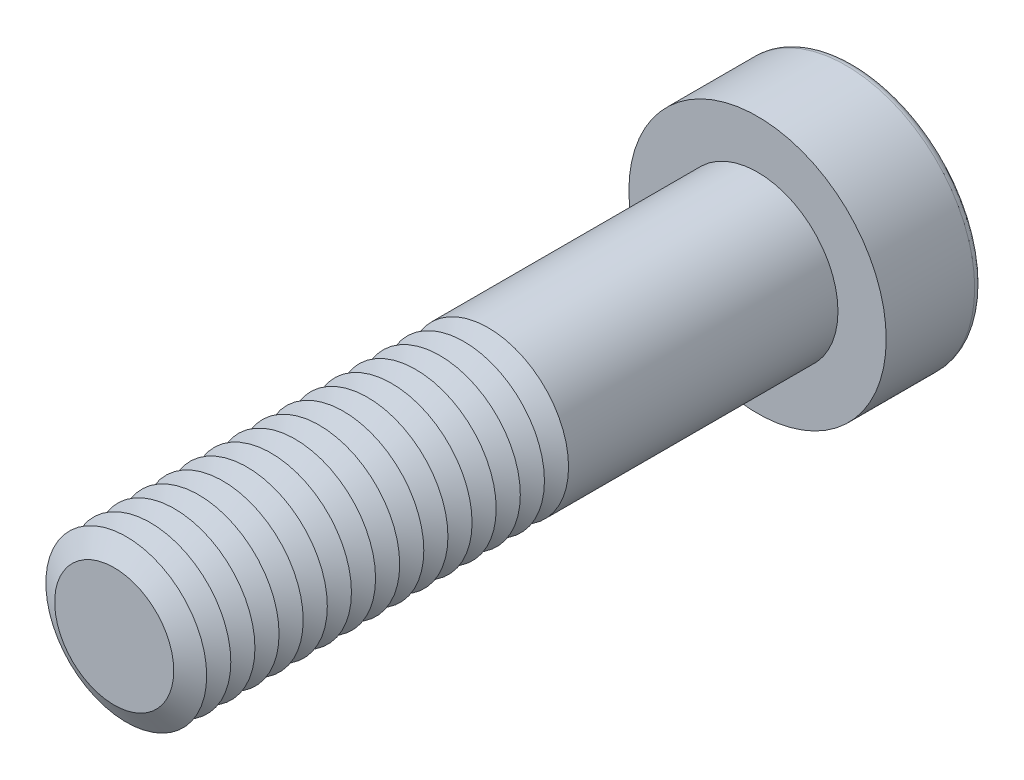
ISO-10303-21;
HEADER;
FILE_DESCRIPTION(('STEP AP214'),'2;1');
FILE_NAME('part.step','',(''),(''),'','','');
FILE_SCHEMA(('AUTOMOTIVE_DESIGN { 1 0 10303 214 1 1 1 1 }'));
ENDSEC;
DATA;
#1=APPLICATION_CONTEXT('core data for automotive mechanical design processes');
#2=APPLICATION_PROTOCOL_DEFINITION('international standard','automotive_design',2000,#1);
#3=PRODUCT_CONTEXT('',#1,'mechanical');
#4=PRODUCT('Part','Part','',(#3));
#5=PRODUCT_RELATED_PRODUCT_CATEGORY('part','',(#4));
#6=PRODUCT_DEFINITION_FORMATION('','',#4);
#7=PRODUCT_DEFINITION_CONTEXT('part definition',#1,'design');
#8=PRODUCT_DEFINITION('design','',#6,#7);
#9=PRODUCT_DEFINITION_SHAPE('','',#8);
#10=(LENGTH_UNIT() NAMED_UNIT(*) SI_UNIT(.MILLI.,.METRE.));
#11=(NAMED_UNIT(*) PLANE_ANGLE_UNIT() SI_UNIT($,.RADIAN.));
#12=(NAMED_UNIT(*) SI_UNIT($,.STERADIAN.) SOLID_ANGLE_UNIT());
#13=UNCERTAINTY_MEASURE_WITH_UNIT(LENGTH_MEASURE(1.E-05),#10,'distance_accuracy_value','');
#14=(GEOMETRIC_REPRESENTATION_CONTEXT(3) GLOBAL_UNCERTAINTY_ASSIGNED_CONTEXT((#13)) GLOBAL_UNIT_ASSIGNED_CONTEXT((#10,
#11,#12)) REPRESENTATION_CONTEXT('',''));
#15=CARTESIAN_POINT('',(0.,0.,0.));
#16=DIRECTION('',(0.,0.,1.));
#17=DIRECTION('',(1.,0.,0.));
#18=AXIS2_PLACEMENT_3D('',#15,#16,#17);
#19=CARTESIAN_POINT('',(0.,0.,34.75));
#20=DIRECTION('',(0.,0.,1.));
#21=DIRECTION('',(1.,0.,0.));
#22=AXIS2_PLACEMENT_3D('',#19,#20,#21);
#23=CONICAL_SURFACE('',#22,5.,1.0471975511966);
#24=CARTESIAN_POINT('',(0.,0.,34.));
#25=DIRECTION('',(0.,0.,1.));
#26=DIRECTION('',(1.,0.,0.));
#27=AXIS2_PLACEMENT_3D('',#24,#25,#26);
#28=CIRCLE('',#27,3.70096189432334);
#29=CARTESIAN_POINT('',(3.70096189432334,0.,34.));
#30=VERTEX_POINT('',#29);
#31=EDGE_CURVE('E313',#30,#30,#28,.T.);
#32=ORIENTED_EDGE('',*,*,#31,.T.);
#33=EDGE_LOOP('',(#32));
#34=FACE_BOUND('',#33,.T.);
#35=CARTESIAN_POINT('',(0.,0.,34.75));
#36=DIRECTION('',(0.,0.,1.));
#37=DIRECTION('',(1.,0.,0.));
#38=AXIS2_PLACEMENT_3D('',#35,#36,#37);
#39=CIRCLE('',#38,5.);
#40=CARTESIAN_POINT('',(5.,0.,34.75));
#41=VERTEX_POINT('',#40);
#42=EDGE_CURVE('E316',#41,#41,#39,.T.);
#43=ORIENTED_EDGE('',*,*,#42,.F.);
#44=EDGE_LOOP('',(#43));
#45=FACE_BOUND('',#44,.T.);
#46=ADVANCED_FACE('F39',(#34,#45),#23,.T.);
#47=CARTESIAN_POINT('',(0.,0.,34.));
#48=DIRECTION('',(0.,0.,-1.));
#49=DIRECTION('',(-1.,0.,0.));
#50=AXIS2_PLACEMENT_3D('',#47,#48,#49);
#51=CONICAL_SURFACE('',#50,3.70096189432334,1.0471975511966);
#52=CARTESIAN_POINT('',(0.,0.,33.25));
#53=DIRECTION('',(0.,0.,1.));
#54=DIRECTION('',(1.,0.,0.));
#55=AXIS2_PLACEMENT_3D('',#52,#53,#54);
#56=CIRCLE('',#55,5.);
#57=CARTESIAN_POINT('',(5.,0.,33.25));
#58=VERTEX_POINT('',#57);
#59=EDGE_CURVE('E324',#58,#58,#56,.T.);
#60=ORIENTED_EDGE('',*,*,#59,.T.);
#61=EDGE_LOOP('',(#60));
#62=FACE_BOUND('',#61,.T.);
#63=ORIENTED_EDGE('',*,*,#31,.F.);
#64=EDGE_LOOP('',(#63));
#65=FACE_BOUND('',#64,.T.);
#66=ADVANCED_FACE('F244',(#62,#65),#51,.T.);
#67=CARTESIAN_POINT('',(0.,0.,40.));
#68=DIRECTION('',(0.,0.,1.));
#69=DIRECTION('',(1.,0.,0.));
#70=AXIS2_PLACEMENT_3D('',#67,#68,#69);
#71=PLANE('',#70);
#72=CARTESIAN_POINT('',(0.,0.,40.));
#73=DIRECTION('',(0.,0.,1.));
#74=DIRECTION('',(1.,0.,0.));
#75=AXIS2_PLACEMENT_3D('',#72,#73,#74);
#76=CIRCLE('',#75,3.70096189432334);
#77=CARTESIAN_POINT('',(3.70096189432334,0.,40.));
#78=VERTEX_POINT('',#77);
#79=EDGE_CURVE('E174',#78,#78,#76,.T.);
#80=ORIENTED_EDGE('',*,*,#79,.T.);
#81=EDGE_LOOP('',(#80));
#82=FACE_BOUND('',#81,.T.);
#83=ADVANCED_FACE('F250',(#82),#71,.T.);
#84=CARTESIAN_POINT('',(0.,0.,40.));
#85=DIRECTION('',(0.,0.,-1.));
#86=DIRECTION('',(-1.,0.,0.));
#87=AXIS2_PLACEMENT_3D('',#84,#85,#86);
#88=CONICAL_SURFACE('',#87,3.70096189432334,1.0471975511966);
#89=CARTESIAN_POINT('',(0.,0.,39.25));
#90=DIRECTION('',(0.,0.,1.));
#91=DIRECTION('',(1.,0.,0.));
#92=AXIS2_PLACEMENT_3D('',#89,#90,#91);
#93=CIRCLE('',#92,5.);
#94=CARTESIAN_POINT('',(5.,0.,39.25));
#95=VERTEX_POINT('',#94);
#96=EDGE_CURVE('E290',#95,#95,#93,.T.);
#97=ORIENTED_EDGE('',*,*,#96,.T.);
#98=EDGE_LOOP('',(#97));
#99=FACE_BOUND('',#98,.T.);
#100=ORIENTED_EDGE('',*,*,#79,.F.);
#101=EDGE_LOOP('',(#100));
#102=FACE_BOUND('',#101,.T.);
#103=ADVANCED_FACE('F199',(#99,#102),#88,.T.);
#104=CARTESIAN_POINT('',(0.,0.,39.25));
#105=DIRECTION('',(0.,0.,1.));
#106=DIRECTION('',(1.,0.,0.));
#107=AXIS2_PLACEMENT_3D('',#104,#105,#106);
#108=CONICAL_SURFACE('',#107,5.,1.0471975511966);
#109=CARTESIAN_POINT('',(0.,0.,38.5));
#110=DIRECTION('',(0.,0.,1.));
#111=DIRECTION('',(1.,0.,0.));
#112=AXIS2_PLACEMENT_3D('',#109,#110,#111);
#113=CIRCLE('',#112,3.70096189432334);
#114=CARTESIAN_POINT('',(3.70096189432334,0.,38.5));
#115=VERTEX_POINT('',#114);
#116=EDGE_CURVE('E287',#115,#115,#113,.T.);
#117=ORIENTED_EDGE('',*,*,#116,.T.);
#118=EDGE_LOOP('',(#117));
#119=FACE_BOUND('',#118,.T.);
#120=ORIENTED_EDGE('',*,*,#96,.F.);
#121=EDGE_LOOP('',(#120));
#122=FACE_BOUND('',#121,.T.);
#123=ADVANCED_FACE('F276',(#119,#122),#108,.T.);
#124=CARTESIAN_POINT('',(0.,0.,38.5));
#125=DIRECTION('',(0.,0.,-1.));
#126=DIRECTION('',(-1.,0.,0.));
#127=AXIS2_PLACEMENT_3D('',#124,#125,#126);
#128=CONICAL_SURFACE('',#127,3.70096189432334,1.0471975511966);
#129=CARTESIAN_POINT('',(0.,0.,37.75));
#130=DIRECTION('',(0.,0.,1.));
#131=DIRECTION('',(1.,0.,0.));
#132=AXIS2_PLACEMENT_3D('',#129,#130,#131);
#133=CIRCLE('',#132,5.);
#134=CARTESIAN_POINT('',(5.,0.,37.75));
#135=VERTEX_POINT('',#134);
#136=EDGE_CURVE('E299',#135,#135,#133,.T.);
#137=ORIENTED_EDGE('',*,*,#136,.T.);
#138=EDGE_LOOP('',(#137));
#139=FACE_BOUND('',#138,.T.);
#140=ORIENTED_EDGE('',*,*,#116,.F.);
#141=EDGE_LOOP('',(#140));
#142=FACE_BOUND('',#141,.T.);
#143=ADVANCED_FACE('F273',(#139,#142),#128,.T.);
#144=CARTESIAN_POINT('',(0.,0.,37.75));
#145=DIRECTION('',(0.,0.,1.));
#146=DIRECTION('',(1.,0.,0.));
#147=AXIS2_PLACEMENT_3D('',#144,#145,#146);
#148=CONICAL_SURFACE('',#147,5.,1.0471975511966);
#149=CARTESIAN_POINT('',(0.,0.,37.));
#150=DIRECTION('',(0.,0.,1.));
#151=DIRECTION('',(1.,0.,0.));
#152=AXIS2_PLACEMENT_3D('',#149,#150,#151);
#153=CIRCLE('',#152,3.70096189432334);
#154=CARTESIAN_POINT('',(3.70096189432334,0.,37.));
#155=VERTEX_POINT('',#154);
#156=EDGE_CURVE('E292',#155,#155,#153,.T.);
#157=ORIENTED_EDGE('',*,*,#156,.T.);
#158=EDGE_LOOP('',(#157));
#159=FACE_BOUND('',#158,.T.);
#160=ORIENTED_EDGE('',*,*,#136,.F.);
#161=EDGE_LOOP('',(#160));
#162=FACE_BOUND('',#161,.T.);
#163=ADVANCED_FACE('F269',(#159,#162),#148,.T.);
#164=CARTESIAN_POINT('',(0.,0.,37.));
#165=DIRECTION('',(0.,0.,-1.));
#166=DIRECTION('',(-1.,0.,0.));
#167=AXIS2_PLACEMENT_3D('',#164,#165,#166);
#168=CONICAL_SURFACE('',#167,3.70096189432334,1.0471975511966);
#169=CARTESIAN_POINT('',(0.,0.,36.25));
#170=DIRECTION('',(0.,0.,1.));
#171=DIRECTION('',(1.,0.,0.));
#172=AXIS2_PLACEMENT_3D('',#169,#170,#171);
#173=CIRCLE('',#172,5.);
#174=CARTESIAN_POINT('',(5.,0.,36.25));
#175=VERTEX_POINT('',#174);
#176=EDGE_CURVE('E309',#175,#175,#173,.T.);
#177=ORIENTED_EDGE('',*,*,#176,.T.);
#178=EDGE_LOOP('',(#177));
#179=FACE_BOUND('',#178,.T.);
#180=ORIENTED_EDGE('',*,*,#156,.F.);
#181=EDGE_LOOP('',(#180));
#182=FACE_BOUND('',#181,.T.);
#183=ADVANCED_FACE('F265',(#179,#182),#168,.T.);
#184=CARTESIAN_POINT('',(0.,0.,36.25));
#185=DIRECTION('',(0.,0.,1.));
#186=DIRECTION('',(1.,0.,0.));
#187=AXIS2_PLACEMENT_3D('',#184,#185,#186);
#188=CONICAL_SURFACE('',#187,5.,1.0471975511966);
#189=CARTESIAN_POINT('',(0.,0.,35.5));
#190=DIRECTION('',(0.,0.,1.));
#191=DIRECTION('',(1.,0.,0.));
#192=AXIS2_PLACEMENT_3D('',#189,#190,#191);
#193=CIRCLE('',#192,3.70096189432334);
#194=CARTESIAN_POINT('',(3.70096189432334,0.,35.5));
#195=VERTEX_POINT('',#194);
#196=EDGE_CURVE('E305',#195,#195,#193,.T.);
#197=ORIENTED_EDGE('',*,*,#196,.T.);
#198=EDGE_LOOP('',(#197));
#199=FACE_BOUND('',#198,.T.);
#200=ORIENTED_EDGE('',*,*,#176,.F.);
#201=EDGE_LOOP('',(#200));
#202=FACE_BOUND('',#201,.T.);
#203=ADVANCED_FACE('F261',(#199,#202),#188,.T.);
#204=CARTESIAN_POINT('',(0.,0.,35.5));
#205=DIRECTION('',(0.,0.,-1.));
#206=DIRECTION('',(-1.,0.,0.));
#207=AXIS2_PLACEMENT_3D('',#204,#205,#206);
#208=CONICAL_SURFACE('',#207,3.70096189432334,1.0471975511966);
#209=ORIENTED_EDGE('',*,*,#42,.T.);
#210=EDGE_LOOP('',(#209));
#211=FACE_BOUND('',#210,.T.);
#212=ORIENTED_EDGE('',*,*,#196,.F.);
#213=EDGE_LOOP('',(#212));
#214=FACE_BOUND('',#213,.T.);
#215=ADVANCED_FACE('F257',(#211,#214),#208,.T.);
#216=CARTESIAN_POINT('',(0.,0.,33.25));
#217=DIRECTION('',(0.,0.,1.));
#218=DIRECTION('',(1.,0.,0.));
#219=AXIS2_PLACEMENT_3D('',#216,#217,#218);
#220=CONICAL_SURFACE('',#219,5.,1.0471975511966);
#221=CARTESIAN_POINT('',(0.,0.,32.5));
#222=DIRECTION('',(0.,0.,1.));
#223=DIRECTION('',(1.,0.,0.));
#224=AXIS2_PLACEMENT_3D('',#221,#222,#223);
#225=CIRCLE('',#224,3.70096189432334);
#226=CARTESIAN_POINT('',(3.70096189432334,0.,32.5));
#227=VERTEX_POINT('',#226);
#228=EDGE_CURVE('E320',#227,#227,#225,.T.);
#229=ORIENTED_EDGE('',*,*,#228,.T.);
#230=EDGE_LOOP('',(#229));
#231=FACE_BOUND('',#230,.T.);
#232=ORIENTED_EDGE('',*,*,#59,.F.);
#233=EDGE_LOOP('',(#232));
#234=FACE_BOUND('',#233,.T.);
#235=ADVANCED_FACE('F260',(#231,#234),#220,.T.);
#236=CARTESIAN_POINT('',(0.,0.,32.5));
#237=DIRECTION('',(0.,0.,-1.));
#238=DIRECTION('',(-1.,0.,0.));
#239=AXIS2_PLACEMENT_3D('',#236,#237,#238);
#240=CONICAL_SURFACE('',#239,3.70096189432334,1.0471975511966);
#241=CARTESIAN_POINT('',(0.,0.,31.75));
#242=DIRECTION('',(0.,0.,1.));
#243=DIRECTION('',(1.,0.,0.));
#244=AXIS2_PLACEMENT_3D('',#241,#242,#243);
#245=CIRCLE('',#244,5.);
#246=CARTESIAN_POINT('',(5.,0.,31.75));
#247=VERTEX_POINT('',#246);
#248=EDGE_CURVE('E331',#247,#247,#245,.T.);
#249=ORIENTED_EDGE('',*,*,#248,.T.);
#250=EDGE_LOOP('',(#249));
#251=FACE_BOUND('',#250,.T.);
#252=ORIENTED_EDGE('',*,*,#228,.F.);
#253=EDGE_LOOP('',(#252));
#254=FACE_BOUND('',#253,.T.);
#255=ADVANCED_FACE('F493',(#251,#254),#240,.T.);
#256=CARTESIAN_POINT('',(0.,0.,31.75));
#257=DIRECTION('',(0.,0.,1.));
#258=DIRECTION('',(1.,0.,0.));
#259=AXIS2_PLACEMENT_3D('',#256,#257,#258);
#260=CONICAL_SURFACE('',#259,5.,1.0471975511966);
#261=CARTESIAN_POINT('',(0.,0.,31.));
#262=DIRECTION('',(0.,0.,1.));
#263=DIRECTION('',(1.,0.,0.));
#264=AXIS2_PLACEMENT_3D('',#261,#262,#263);
#265=CIRCLE('',#264,3.70096189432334);
#266=CARTESIAN_POINT('',(3.70096189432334,0.,31.));
#267=VERTEX_POINT('',#266);
#268=EDGE_CURVE('E327',#267,#267,#265,.T.);
#269=ORIENTED_EDGE('',*,*,#268,.T.);
#270=EDGE_LOOP('',(#269));
#271=FACE_BOUND('',#270,.T.);
#272=ORIENTED_EDGE('',*,*,#248,.F.);
#273=EDGE_LOOP('',(#272));
#274=FACE_BOUND('',#273,.T.);
#275=ADVANCED_FACE('F489',(#271,#274),#260,.T.);
#276=CARTESIAN_POINT('',(0.,0.,31.));
#277=DIRECTION('',(0.,0.,-1.));
#278=DIRECTION('',(-1.,0.,0.));
#279=AXIS2_PLACEMENT_3D('',#276,#277,#278);
#280=CONICAL_SURFACE('',#279,3.70096189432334,1.0471975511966);
#281=CARTESIAN_POINT('',(0.,0.,30.25));
#282=DIRECTION('',(0.,0.,1.));
#283=DIRECTION('',(1.,0.,0.));
#284=AXIS2_PLACEMENT_3D('',#281,#282,#283);
#285=CIRCLE('',#284,5.);
#286=CARTESIAN_POINT('',(5.,0.,30.25));
#287=VERTEX_POINT('',#286);
#288=EDGE_CURVE('E339',#287,#287,#285,.T.);
#289=ORIENTED_EDGE('',*,*,#288,.T.);
#290=EDGE_LOOP('',(#289));
#291=FACE_BOUND('',#290,.T.);
#292=ORIENTED_EDGE('',*,*,#268,.F.);
#293=EDGE_LOOP('',(#292));
#294=FACE_BOUND('',#293,.T.);
#295=ADVANCED_FACE('F485',(#291,#294),#280,.T.);
#296=CARTESIAN_POINT('',(0.,0.,30.25));
#297=DIRECTION('',(0.,0.,1.));
#298=DIRECTION('',(1.,0.,0.));
#299=AXIS2_PLACEMENT_3D('',#296,#297,#298);
#300=CONICAL_SURFACE('',#299,5.,1.0471975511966);
#301=CARTESIAN_POINT('',(0.,0.,29.5));
#302=DIRECTION('',(0.,0.,1.));
#303=DIRECTION('',(1.,0.,0.));
#304=AXIS2_PLACEMENT_3D('',#301,#302,#303);
#305=CIRCLE('',#304,3.70096189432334);
#306=CARTESIAN_POINT('',(3.70096189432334,0.,29.5));
#307=VERTEX_POINT('',#306);
#308=EDGE_CURVE('E335',#307,#307,#305,.T.);
#309=ORIENTED_EDGE('',*,*,#308,.T.);
#310=EDGE_LOOP('',(#309));
#311=FACE_BOUND('',#310,.T.);
#312=ORIENTED_EDGE('',*,*,#288,.F.);
#313=EDGE_LOOP('',(#312));
#314=FACE_BOUND('',#313,.T.);
#315=ADVANCED_FACE('F481',(#311,#314),#300,.T.);
#316=CARTESIAN_POINT('',(0.,0.,29.5));
#317=DIRECTION('',(0.,0.,-1.));
#318=DIRECTION('',(-1.,0.,0.));
#319=AXIS2_PLACEMENT_3D('',#316,#317,#318);
#320=CONICAL_SURFACE('',#319,3.70096189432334,1.0471975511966);
#321=CARTESIAN_POINT('',(0.,0.,28.75));
#322=DIRECTION('',(0.,0.,1.));
#323=DIRECTION('',(1.,0.,0.));
#324=AXIS2_PLACEMENT_3D('',#321,#322,#323);
#325=CIRCLE('',#324,5.);
#326=CARTESIAN_POINT('',(5.,0.,28.75));
#327=VERTEX_POINT('',#326);
#328=EDGE_CURVE('E346',#327,#327,#325,.T.);
#329=ORIENTED_EDGE('',*,*,#328,.T.);
#330=EDGE_LOOP('',(#329));
#331=FACE_BOUND('',#330,.T.);
#332=ORIENTED_EDGE('',*,*,#308,.F.);
#333=EDGE_LOOP('',(#332));
#334=FACE_BOUND('',#333,.T.);
#335=ADVANCED_FACE('F477',(#331,#334),#320,.T.);
#336=CARTESIAN_POINT('',(0.,0.,28.75));
#337=DIRECTION('',(0.,0.,1.));
#338=DIRECTION('',(1.,0.,0.));
#339=AXIS2_PLACEMENT_3D('',#336,#337,#338);
#340=CONICAL_SURFACE('',#339,5.,1.0471975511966);
#341=CARTESIAN_POINT('',(0.,0.,28.));
#342=DIRECTION('',(0.,0.,1.));
#343=DIRECTION('',(1.,0.,0.));
#344=AXIS2_PLACEMENT_3D('',#341,#342,#343);
#345=CIRCLE('',#344,3.70096189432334);
#346=CARTESIAN_POINT('',(3.70096189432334,0.,28.));
#347=VERTEX_POINT('',#346);
#348=EDGE_CURVE('E343',#347,#347,#345,.T.);
#349=ORIENTED_EDGE('',*,*,#348,.T.);
#350=EDGE_LOOP('',(#349));
#351=FACE_BOUND('',#350,.T.);
#352=ORIENTED_EDGE('',*,*,#328,.F.);
#353=EDGE_LOOP('',(#352));
#354=FACE_BOUND('',#353,.T.);
#355=ADVANCED_FACE('F473',(#351,#354),#340,.T.);
#356=CARTESIAN_POINT('',(0.,0.,28.));
#357=DIRECTION('',(0.,0.,-1.));
#358=DIRECTION('',(-1.,0.,0.));
#359=AXIS2_PLACEMENT_3D('',#356,#357,#358);
#360=CONICAL_SURFACE('',#359,3.70096189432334,1.0471975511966);
#361=CARTESIAN_POINT('',(0.,0.,27.25));
#362=DIRECTION('',(0.,0.,1.));
#363=DIRECTION('',(1.,0.,0.));
#364=AXIS2_PLACEMENT_3D('',#361,#362,#363);
#365=CIRCLE('',#364,5.);
#366=CARTESIAN_POINT('',(5.,0.,27.25));
#367=VERTEX_POINT('',#366);
#368=EDGE_CURVE('E354',#367,#367,#365,.T.);
#369=ORIENTED_EDGE('',*,*,#368,.T.);
#370=EDGE_LOOP('',(#369));
#371=FACE_BOUND('',#370,.T.);
#372=ORIENTED_EDGE('',*,*,#348,.F.);
#373=EDGE_LOOP('',(#372));
#374=FACE_BOUND('',#373,.T.);
#375=ADVANCED_FACE('F469',(#371,#374),#360,.T.);
#376=CARTESIAN_POINT('',(0.,0.,27.25));
#377=DIRECTION('',(0.,0.,1.));
#378=DIRECTION('',(1.,0.,0.));
#379=AXIS2_PLACEMENT_3D('',#376,#377,#378);
#380=CONICAL_SURFACE('',#379,5.,1.0471975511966);
#381=CARTESIAN_POINT('',(0.,0.,26.5));
#382=DIRECTION('',(0.,0.,1.));
#383=DIRECTION('',(1.,0.,0.));
#384=AXIS2_PLACEMENT_3D('',#381,#382,#383);
#385=CIRCLE('',#384,3.70096189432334);
#386=CARTESIAN_POINT('',(3.70096189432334,0.,26.5));
#387=VERTEX_POINT('',#386);
#388=EDGE_CURVE('E350',#387,#387,#385,.T.);
#389=ORIENTED_EDGE('',*,*,#388,.T.);
#390=EDGE_LOOP('',(#389));
#391=FACE_BOUND('',#390,.T.);
#392=ORIENTED_EDGE('',*,*,#368,.F.);
#393=EDGE_LOOP('',(#392));
#394=FACE_BOUND('',#393,.T.);
#395=ADVANCED_FACE('F465',(#391,#394),#380,.T.);
#396=CARTESIAN_POINT('',(0.,0.,26.5));
#397=DIRECTION('',(0.,0.,-1.));
#398=DIRECTION('',(-1.,0.,0.));
#399=AXIS2_PLACEMENT_3D('',#396,#397,#398);
#400=CONICAL_SURFACE('',#399,3.70096189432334,1.0471975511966);
#401=CARTESIAN_POINT('',(0.,0.,25.75));
#402=DIRECTION('',(0.,0.,1.));
#403=DIRECTION('',(1.,0.,0.));
#404=AXIS2_PLACEMENT_3D('',#401,#402,#403);
#405=CIRCLE('',#404,5.);
#406=CARTESIAN_POINT('',(5.,0.,25.75));
#407=VERTEX_POINT('',#406);
#408=EDGE_CURVE('E362',#407,#407,#405,.T.);
#409=ORIENTED_EDGE('',*,*,#408,.T.);
#410=EDGE_LOOP('',(#409));
#411=FACE_BOUND('',#410,.T.);
#412=ORIENTED_EDGE('',*,*,#388,.F.);
#413=EDGE_LOOP('',(#412));
#414=FACE_BOUND('',#413,.T.);
#415=ADVANCED_FACE('F461',(#411,#414),#400,.T.);
#416=CARTESIAN_POINT('',(0.,0.,25.75));
#417=DIRECTION('',(0.,0.,1.));
#418=DIRECTION('',(1.,0.,0.));
#419=AXIS2_PLACEMENT_3D('',#416,#417,#418);
#420=CONICAL_SURFACE('',#419,5.,1.0471975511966);
#421=CARTESIAN_POINT('',(0.,0.,25.));
#422=DIRECTION('',(0.,0.,1.));
#423=DIRECTION('',(1.,0.,0.));
#424=AXIS2_PLACEMENT_3D('',#421,#422,#423);
#425=CIRCLE('',#424,3.70096189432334);
#426=CARTESIAN_POINT('',(3.70096189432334,0.,25.));
#427=VERTEX_POINT('',#426);
#428=EDGE_CURVE('E358',#427,#427,#425,.T.);
#429=ORIENTED_EDGE('',*,*,#428,.T.);
#430=EDGE_LOOP('',(#429));
#431=FACE_BOUND('',#430,.T.);
#432=ORIENTED_EDGE('',*,*,#408,.F.);
#433=EDGE_LOOP('',(#432));
#434=FACE_BOUND('',#433,.T.);
#435=ADVANCED_FACE('F457',(#431,#434),#420,.T.);
#436=CARTESIAN_POINT('',(0.,0.,25.));
#437=DIRECTION('',(0.,0.,-1.));
#438=DIRECTION('',(-1.,0.,0.));
#439=AXIS2_PLACEMENT_3D('',#436,#437,#438);
#440=CONICAL_SURFACE('',#439,3.70096189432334,1.0471975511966);
#441=CARTESIAN_POINT('',(0.,0.,24.25));
#442=DIRECTION('',(0.,0.,1.));
#443=DIRECTION('',(1.,0.,0.));
#444=AXIS2_PLACEMENT_3D('',#441,#442,#443);
#445=CIRCLE('',#444,5.);
#446=CARTESIAN_POINT('',(5.,0.,24.25));
#447=VERTEX_POINT('',#446);
#448=EDGE_CURVE('E370',#447,#447,#445,.T.);
#449=ORIENTED_EDGE('',*,*,#448,.T.);
#450=EDGE_LOOP('',(#449));
#451=FACE_BOUND('',#450,.T.);
#452=ORIENTED_EDGE('',*,*,#428,.F.);
#453=EDGE_LOOP('',(#452));
#454=FACE_BOUND('',#453,.T.);
#455=ADVANCED_FACE('F453',(#451,#454),#440,.T.);
#456=CARTESIAN_POINT('',(0.,0.,24.25));
#457=DIRECTION('',(0.,0.,1.));
#458=DIRECTION('',(1.,0.,0.));
#459=AXIS2_PLACEMENT_3D('',#456,#457,#458);
#460=CONICAL_SURFACE('',#459,5.,1.0471975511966);
#461=CARTESIAN_POINT('',(0.,0.,23.5));
#462=DIRECTION('',(0.,0.,1.));
#463=DIRECTION('',(1.,0.,0.));
#464=AXIS2_PLACEMENT_3D('',#461,#462,#463);
#465=CIRCLE('',#464,3.70096189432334);
#466=CARTESIAN_POINT('',(3.70096189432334,0.,23.5));
#467=VERTEX_POINT('',#466);
#468=EDGE_CURVE('E366',#467,#467,#465,.T.);
#469=ORIENTED_EDGE('',*,*,#468,.T.);
#470=EDGE_LOOP('',(#469));
#471=FACE_BOUND('',#470,.T.);
#472=ORIENTED_EDGE('',*,*,#448,.F.);
#473=EDGE_LOOP('',(#472));
#474=FACE_BOUND('',#473,.T.);
#475=ADVANCED_FACE('F449',(#471,#474),#460,.T.);
#476=CARTESIAN_POINT('',(0.,0.,23.5));
#477=DIRECTION('',(0.,0.,-1.));
#478=DIRECTION('',(-1.,0.,0.));
#479=AXIS2_PLACEMENT_3D('',#476,#477,#478);
#480=CONICAL_SURFACE('',#479,3.70096189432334,1.0471975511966);
#481=CARTESIAN_POINT('',(0.,0.,22.75));
#482=DIRECTION('',(0.,0.,1.));
#483=DIRECTION('',(1.,0.,0.));
#484=AXIS2_PLACEMENT_3D('',#481,#482,#483);
#485=CIRCLE('',#484,5.);
#486=CARTESIAN_POINT('',(5.,0.,22.75));
#487=VERTEX_POINT('',#486);
#488=EDGE_CURVE('E378',#487,#487,#485,.T.);
#489=ORIENTED_EDGE('',*,*,#488,.T.);
#490=EDGE_LOOP('',(#489));
#491=FACE_BOUND('',#490,.T.);
#492=ORIENTED_EDGE('',*,*,#468,.F.);
#493=EDGE_LOOP('',(#492));
#494=FACE_BOUND('',#493,.T.);
#495=ADVANCED_FACE('F445',(#491,#494),#480,.T.);
#496=CARTESIAN_POINT('',(0.,0.,22.75));
#497=DIRECTION('',(0.,0.,1.));
#498=DIRECTION('',(1.,0.,0.));
#499=AXIS2_PLACEMENT_3D('',#496,#497,#498);
#500=CONICAL_SURFACE('',#499,5.,1.0471975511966);
#501=CARTESIAN_POINT('',(0.,0.,22.));
#502=DIRECTION('',(0.,0.,1.));
#503=DIRECTION('',(1.,0.,0.));
#504=AXIS2_PLACEMENT_3D('',#501,#502,#503);
#505=CIRCLE('',#504,3.70096189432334);
#506=CARTESIAN_POINT('',(3.70096189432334,0.,22.));
#507=VERTEX_POINT('',#506);
#508=EDGE_CURVE('E374',#507,#507,#505,.T.);
#509=ORIENTED_EDGE('',*,*,#508,.T.);
#510=EDGE_LOOP('',(#509));
#511=FACE_BOUND('',#510,.T.);
#512=ORIENTED_EDGE('',*,*,#488,.F.);
#513=EDGE_LOOP('',(#512));
#514=FACE_BOUND('',#513,.T.);
#515=ADVANCED_FACE('F441',(#511,#514),#500,.T.);
#516=CARTESIAN_POINT('',(0.,0.,22.));
#517=DIRECTION('',(0.,0.,-1.));
#518=DIRECTION('',(-1.,0.,0.));
#519=AXIS2_PLACEMENT_3D('',#516,#517,#518);
#520=CONICAL_SURFACE('',#519,3.70096189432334,1.0471975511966);
#521=CARTESIAN_POINT('',(0.,0.,21.25));
#522=DIRECTION('',(0.,0.,1.));
#523=DIRECTION('',(1.,0.,0.));
#524=AXIS2_PLACEMENT_3D('',#521,#522,#523);
#525=CIRCLE('',#524,5.);
#526=CARTESIAN_POINT('',(5.,0.,21.25));
#527=VERTEX_POINT('',#526);
#528=EDGE_CURVE('E385',#527,#527,#525,.T.);
#529=ORIENTED_EDGE('',*,*,#528,.T.);
#530=EDGE_LOOP('',(#529));
#531=FACE_BOUND('',#530,.T.);
#532=ORIENTED_EDGE('',*,*,#508,.F.);
#533=EDGE_LOOP('',(#532));
#534=FACE_BOUND('',#533,.T.);
#535=ADVANCED_FACE('F437',(#531,#534),#520,.T.);
#536=CARTESIAN_POINT('',(0.,0.,21.25));
#537=DIRECTION('',(0.,0.,1.));
#538=DIRECTION('',(1.,0.,0.));
#539=AXIS2_PLACEMENT_3D('',#536,#537,#538);
#540=CONICAL_SURFACE('',#539,5.,1.0471975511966);
#541=CARTESIAN_POINT('',(0.,0.,20.5));
#542=DIRECTION('',(0.,0.,1.));
#543=DIRECTION('',(1.,0.,0.));
#544=AXIS2_PLACEMENT_3D('',#541,#542,#543);
#545=CIRCLE('',#544,3.70096189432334);
#546=CARTESIAN_POINT('',(3.70096189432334,0.,20.5));
#547=VERTEX_POINT('',#546);
#548=EDGE_CURVE('E382',#547,#547,#545,.T.);
#549=ORIENTED_EDGE('',*,*,#548,.T.);
#550=EDGE_LOOP('',(#549));
#551=FACE_BOUND('',#550,.T.);
#552=ORIENTED_EDGE('',*,*,#528,.F.);
#553=EDGE_LOOP('',(#552));
#554=FACE_BOUND('',#553,.T.);
#555=ADVANCED_FACE('F433',(#551,#554),#540,.T.);
#556=CARTESIAN_POINT('',(0.,0.,20.5));
#557=DIRECTION('',(0.,0.,-1.));
#558=DIRECTION('',(-1.,0.,0.));
#559=AXIS2_PLACEMENT_3D('',#556,#557,#558);
#560=CONICAL_SURFACE('',#559,3.70096189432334,1.0471975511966);
#561=CARTESIAN_POINT('',(0.,0.,19.75));
#562=DIRECTION('',(0.,0.,1.));
#563=DIRECTION('',(1.,0.,0.));
#564=AXIS2_PLACEMENT_3D('',#561,#562,#563);
#565=CIRCLE('',#564,5.);
#566=CARTESIAN_POINT('',(5.,0.,19.75));
#567=VERTEX_POINT('',#566);
#568=EDGE_CURVE('E393',#567,#567,#565,.T.);
#569=ORIENTED_EDGE('',*,*,#568,.T.);
#570=EDGE_LOOP('',(#569));
#571=FACE_BOUND('',#570,.T.);
#572=ORIENTED_EDGE('',*,*,#548,.F.);
#573=EDGE_LOOP('',(#572));
#574=FACE_BOUND('',#573,.T.);
#575=ADVANCED_FACE('F429',(#571,#574),#560,.T.);
#576=CARTESIAN_POINT('',(0.,0.,19.75));
#577=DIRECTION('',(0.,0.,1.));
#578=DIRECTION('',(1.,0.,0.));
#579=AXIS2_PLACEMENT_3D('',#576,#577,#578);
#580=CONICAL_SURFACE('',#579,5.,1.0471975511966);
#581=CARTESIAN_POINT('',(0.,0.,19.));
#582=DIRECTION('',(0.,0.,1.));
#583=DIRECTION('',(1.,0.,0.));
#584=AXIS2_PLACEMENT_3D('',#581,#582,#583);
#585=CIRCLE('',#584,3.70096189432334);
#586=CARTESIAN_POINT('',(3.70096189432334,0.,19.));
#587=VERTEX_POINT('',#586);
#588=EDGE_CURVE('E389',#587,#587,#585,.T.);
#589=ORIENTED_EDGE('',*,*,#588,.T.);
#590=EDGE_LOOP('',(#589));
#591=FACE_BOUND('',#590,.T.);
#592=ORIENTED_EDGE('',*,*,#568,.F.);
#593=EDGE_LOOP('',(#592));
#594=FACE_BOUND('',#593,.T.);
#595=ADVANCED_FACE('F424',(#591,#594),#580,.T.);
#596=CARTESIAN_POINT('',(0.,0.,19.));
#597=DIRECTION('',(0.,0.,-1.));
#598=DIRECTION('',(-1.,0.,0.));
#599=AXIS2_PLACEMENT_3D('',#596,#597,#598);
#600=CONICAL_SURFACE('',#599,3.70096189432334,1.0471975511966);
#601=CARTESIAN_POINT('',(0.,0.,18.25));
#602=DIRECTION('',(0.,0.,1.));
#603=DIRECTION('',(1.,0.,0.));
#604=AXIS2_PLACEMENT_3D('',#601,#602,#603);
#605=CIRCLE('',#604,5.);
#606=CARTESIAN_POINT('',(5.,0.,18.25));
#607=VERTEX_POINT('',#606);
#608=EDGE_CURVE('E405',#607,#607,#605,.T.);
#609=ORIENTED_EDGE('',*,*,#608,.T.);
#610=EDGE_LOOP('',(#609));
#611=FACE_BOUND('',#610,.T.);
#612=ORIENTED_EDGE('',*,*,#588,.F.);
#613=EDGE_LOOP('',(#612));
#614=FACE_BOUND('',#613,.T.);
#615=ADVANCED_FACE('F410',(#611,#614),#600,.T.);
#616=CARTESIAN_POINT('',(0.,0.,18.25));
#617=DIRECTION('',(0.,0.,1.));
#618=DIRECTION('',(1.,0.,0.));
#619=AXIS2_PLACEMENT_3D('',#616,#617,#618);
#620=CONICAL_SURFACE('',#619,5.,1.0471975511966);
#621=CARTESIAN_POINT('',(0.,0.,17.5));
#622=DIRECTION('',(0.,0.,1.));
#623=DIRECTION('',(1.,0.,0.));
#624=AXIS2_PLACEMENT_3D('',#621,#622,#623);
#625=CIRCLE('',#624,3.70096189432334);
#626=CARTESIAN_POINT('',(3.70096189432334,0.,17.5));
#627=VERTEX_POINT('',#626);
#628=EDGE_CURVE('E397',#627,#627,#625,.T.);
#629=ORIENTED_EDGE('',*,*,#628,.T.);
#630=EDGE_LOOP('',(#629));
#631=FACE_BOUND('',#630,.T.);
#632=ORIENTED_EDGE('',*,*,#608,.F.);
#633=EDGE_LOOP('',(#632));
#634=FACE_BOUND('',#633,.T.);
#635=ADVANCED_FACE('F413',(#631,#634),#620,.T.);
#636=CARTESIAN_POINT('',(0.,0.,17.5));
#637=DIRECTION('',(0.,0.,-1.));
#638=DIRECTION('',(-1.,0.,0.));
#639=AXIS2_PLACEMENT_3D('',#636,#637,#638);
#640=CONICAL_SURFACE('',#639,3.70096189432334,1.0471975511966);
#641=CARTESIAN_POINT('',(0.,0.,16.75));
#642=DIRECTION('',(0.,0.,1.));
#643=DIRECTION('',(1.,0.,0.));
#644=AXIS2_PLACEMENT_3D('',#641,#642,#643);
#645=CIRCLE('',#644,5.);
#646=CARTESIAN_POINT('',(5.,0.,16.75));
#647=VERTEX_POINT('',#646);
#648=EDGE_CURVE('E401',#647,#647,#645,.T.);
#649=ORIENTED_EDGE('',*,*,#648,.T.);
#650=EDGE_LOOP('',(#649));
#651=FACE_BOUND('',#650,.T.);
#652=ORIENTED_EDGE('',*,*,#628,.F.);
#653=EDGE_LOOP('',(#652));
#654=FACE_BOUND('',#653,.T.);
#655=ADVANCED_FACE('F415',(#651,#654),#640,.T.);
#656=CARTESIAN_POINT('',(0.,0.,-0.75));
#657=DIRECTION('',(0.,0.,-1.));
#658=DIRECTION('',(-1.,0.,0.));
#659=AXIS2_PLACEMENT_3D('',#656,#657,#658);
#660=CONICAL_SURFACE('',#659,3.5,1.0471975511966);
#661=CARTESIAN_POINT('',(0.,0.,1.27072594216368));
#662=VERTEX_POINT('',#661);
#663=VERTEX_LOOP('',#662);
#664=FACE_BOUND('',#663,.T.);
#665=CARTESIAN_POINT('',(0.,0.,-0.75));
#666=DIRECTION('',(0.,0.,-1.));
#667=DIRECTION('',(-1.,0.,0.));
#668=AXIS2_PLACEMENT_3D('',#665,#666,#667);
#669=CIRCLE('',#668,3.5);
#670=CARTESIAN_POINT('',(-3.03108891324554,1.75,-0.75));
#671=VERTEX_POINT('',#670);
#672=CARTESIAN_POINT('',(0.,3.5,-0.75));
#673=VERTEX_POINT('',#672);
#674=EDGE_CURVE('E149',#671,#673,#669,.T.);
#675=ORIENTED_EDGE('',*,*,#674,.T.);
#676=CARTESIAN_POINT('',(0.,0.,-0.75));
#677=DIRECTION('',(0.,0.,-1.));
#678=DIRECTION('',(-1.,0.,0.));
#679=AXIS2_PLACEMENT_3D('',#676,#677,#678);
#680=CIRCLE('',#679,3.5);
#681=CARTESIAN_POINT('',(3.03108891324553,1.75,-0.75));
#682=VERTEX_POINT('',#681);
#683=EDGE_CURVE('E54',#673,#682,#680,.T.);
#684=ORIENTED_EDGE('',*,*,#683,.T.);
#685=CARTESIAN_POINT('',(3.03108891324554,-1.75,-0.75));
#686=VERTEX_POINT('',#685);
#687=EDGE_CURVE('E995',#682,#686,#680,.T.);
#688=ORIENTED_EDGE('',*,*,#687,.T.);
#689=CARTESIAN_POINT('',(0.,-3.5,-0.75));
#690=VERTEX_POINT('',#689);
#691=EDGE_CURVE('E993',#686,#690,#680,.T.);
#692=ORIENTED_EDGE('',*,*,#691,.T.);
#693=CARTESIAN_POINT('',(-3.03108891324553,-1.75,-0.75));
#694=VERTEX_POINT('',#693);
#695=EDGE_CURVE('E988',#690,#694,#680,.T.);
#696=ORIENTED_EDGE('',*,*,#695,.T.);
#697=EDGE_CURVE('E986',#694,#671,#680,.T.);
#698=ORIENTED_EDGE('',*,*,#697,.T.);
#699=EDGE_LOOP('',(#675,#684,#688,#692,#696,#698));
#700=FACE_BOUND('',#699,.T.);
#701=ADVANCED_FACE('F201',(#664,#700),#660,.F.);
#702=CARTESIAN_POINT('',(0.,0.,-0.75));
#703=DIRECTION('',(0.,0.,-1.));
#704=DIRECTION('',(-1.,0.,0.));
#705=AXIS2_PLACEMENT_3D('',#702,#703,#704);
#706=PLANE('',#705);
#707=ORIENTED_EDGE('',*,*,#683,.F.);
#708=DIRECTION('',(1.,0.,0.));
#709=VECTOR('',#708,1.);
#710=CARTESIAN_POINT('',(-2.02072594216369,3.5,-0.75));
#711=LINE('',#710,#709);
#712=CARTESIAN_POINT('',(2.02072594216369,3.5,-0.75));
#713=VERTEX_POINT('',#712);
#714=EDGE_CURVE('E1036',#673,#713,#711,.T.);
#715=ORIENTED_EDGE('',*,*,#714,.T.);
#716=DIRECTION('',(0.5,-0.866025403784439,0.));
#717=VECTOR('',#716,1.);
#718=CARTESIAN_POINT('',(2.02072594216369,3.5,-0.75));
#719=LINE('',#718,#717);
#720=EDGE_CURVE('E155',#713,#682,#719,.T.);
#721=ORIENTED_EDGE('',*,*,#720,.T.);
#722=EDGE_LOOP('',(#707,#715,#721));
#723=FACE_BOUND('',#722,.T.);
#724=ADVANCED_FACE('F582',(#723),#706,.T.);
#725=ORIENTED_EDGE('',*,*,#687,.F.);
#726=CARTESIAN_POINT('',(4.04145188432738,0.,-0.75));
#727=VERTEX_POINT('',#726);
#728=EDGE_CURVE('E1035',#682,#727,#719,.T.);
#729=ORIENTED_EDGE('',*,*,#728,.T.);
#730=DIRECTION('',(-0.5,-0.866025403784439,0.));
#731=VECTOR('',#730,1.);
#732=CARTESIAN_POINT('',(4.04145188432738,0.,-0.75));
#733=LINE('',#732,#731);
#734=EDGE_CURVE('E1007',#727,#686,#733,.T.);
#735=ORIENTED_EDGE('',*,*,#734,.T.);
#736=EDGE_LOOP('',(#725,#729,#735));
#737=FACE_BOUND('',#736,.T.);
#738=ADVANCED_FACE('F592',(#737),#706,.T.);
#739=ORIENTED_EDGE('',*,*,#691,.F.);
#740=CARTESIAN_POINT('',(2.02072594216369,-3.5,-0.75));
#741=VERTEX_POINT('',#740);
#742=EDGE_CURVE('E1009',#686,#741,#733,.T.);
#743=ORIENTED_EDGE('',*,*,#742,.T.);
#744=DIRECTION('',(-1.,0.,0.));
#745=VECTOR('',#744,1.);
#746=CARTESIAN_POINT('',(2.02072594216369,-3.5,-0.75));
#747=LINE('',#746,#745);
#748=EDGE_CURVE('E959',#741,#690,#747,.T.);
#749=ORIENTED_EDGE('',*,*,#748,.T.);
#750=EDGE_LOOP('',(#739,#743,#749));
#751=FACE_BOUND('',#750,.T.);
#752=ADVANCED_FACE('F602',(#751),#706,.T.);
#753=ORIENTED_EDGE('',*,*,#695,.F.);
#754=CARTESIAN_POINT('',(-2.02072594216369,-3.5,-0.75));
#755=VERTEX_POINT('',#754);
#756=EDGE_CURVE('E1003',#690,#755,#747,.T.);
#757=ORIENTED_EDGE('',*,*,#756,.T.);
#758=DIRECTION('',(-0.5,0.866025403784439,0.));
#759=VECTOR('',#758,1.);
#760=CARTESIAN_POINT('',(-2.02072594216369,-3.5,-0.75));
#761=LINE('',#760,#759);
#762=EDGE_CURVE('E1005',#755,#694,#761,.T.);
#763=ORIENTED_EDGE('',*,*,#762,.T.);
#764=EDGE_LOOP('',(#753,#757,#763));
#765=FACE_BOUND('',#764,.T.);
#766=ADVANCED_FACE('F610',(#765),#706,.T.);
#767=ORIENTED_EDGE('',*,*,#697,.F.);
#768=CARTESIAN_POINT('',(-4.04145188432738,0.,-0.75));
#769=VERTEX_POINT('',#768);
#770=EDGE_CURVE('E1011',#694,#769,#761,.T.);
#771=ORIENTED_EDGE('',*,*,#770,.T.);
#772=DIRECTION('',(0.5,0.866025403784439,0.));
#773=VECTOR('',#772,1.);
#774=CARTESIAN_POINT('',(-4.04145188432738,0.,-0.75));
#775=LINE('',#774,#773);
#776=EDGE_CURVE('E158',#769,#671,#775,.T.);
#777=ORIENTED_EDGE('',*,*,#776,.T.);
#778=EDGE_LOOP('',(#767,#771,#777));
#779=FACE_BOUND('',#778,.T.);
#780=ADVANCED_FACE('F230',(#779),#706,.T.);
#781=ORIENTED_EDGE('',*,*,#674,.F.);
#782=CARTESIAN_POINT('',(-2.02072594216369,3.5,-0.75));
#783=VERTEX_POINT('',#782);
#784=EDGE_CURVE('E1018',#671,#783,#775,.T.);
#785=ORIENTED_EDGE('',*,*,#784,.T.);
#786=EDGE_CURVE('E1032',#783,#673,#711,.T.);
#787=ORIENTED_EDGE('',*,*,#786,.T.);
#788=EDGE_LOOP('',(#781,#785,#787));
#789=FACE_BOUND('',#788,.T.);
#790=ADVANCED_FACE('F594',(#789),#706,.T.);
#791=CARTESIAN_POINT('',(-2.02072594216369,3.5,-0.75));
#792=DIRECTION('',(0.,1.,0.));
#793=DIRECTION('',(-1.,0.,0.));
#794=AXIS2_PLACEMENT_3D('',#791,#792,#793);
#795=PLANE('',#794);
#796=DIRECTION('',(0.,0.,-1.));
#797=VECTOR('',#796,1.);
#798=CARTESIAN_POINT('',(-2.02072594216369,3.5,-0.75));
#799=LINE('',#798,#797);
#800=CARTESIAN_POINT('',(-2.02072594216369,3.5,-6.));
#801=VERTEX_POINT('',#800);
#802=EDGE_CURVE('E147',#783,#801,#799,.T.);
#803=ORIENTED_EDGE('',*,*,#802,.T.);
#804=CARTESIAN_POINT('',(-5.27521327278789,3.5,-6.613404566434));
#805=CARTESIAN_POINT('',(-5.11717138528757,3.5,-6.57812703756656));
#806=CARTESIAN_POINT('',(-4.95902873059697,3.5,-6.5432936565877));
#807=CARTESIAN_POINT('',(-4.64249233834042,3.5,-6.47475322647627));
#808=CARTESIAN_POINT('',(-4.48409858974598,3.5,-6.44104622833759));
#809=CARTESIAN_POINT('',(-4.16686075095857,3.5,-6.37496567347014));
#810=CARTESIAN_POINT('',(-4.00801636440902,3.5,-6.34259353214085));
#811=CARTESIAN_POINT('',(-3.68999232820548,3.5,-6.27954992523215));
#812=CARTESIAN_POINT('',(-3.53081268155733,3.5,-6.24887844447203));
#813=CARTESIAN_POINT('',(-3.05545711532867,3.5,-6.16049717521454));
#814=CARTESIAN_POINT('',(-2.73870333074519,3.5,-6.10583257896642));
#815=CARTESIAN_POINT('',(-2.10326379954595,3.5,-6.00899390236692));
#816=CARTESIAN_POINT('',(-1.78457845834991,3.5,-5.9668172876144));
#817=CARTESIAN_POINT('',(-1.30331397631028,3.5,-5.91703310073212));
#818=CARTESIAN_POINT('',(-1.14143900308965,3.5,-5.90264327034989));
#819=CARTESIAN_POINT('',(-0.817296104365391,3.5,-5.87924021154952));
#820=CARTESIAN_POINT('',(-0.655028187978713,3.5,-5.87022685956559));
#821=CARTESIAN_POINT('',(-0.330337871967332,3.5,-5.8581019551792));
#822=CARTESIAN_POINT('',(-0.167915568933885,3.5,-5.85498786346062));
#823=CARTESIAN_POINT('',(0.156931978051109,3.5,-5.85485125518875));
#824=CARTESIAN_POINT('',(0.319357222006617,3.5,-5.8578287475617));
#825=CARTESIAN_POINT('',(0.644649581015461,3.5,-5.86971076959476));
#826=CARTESIAN_POINT('',(0.807515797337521,3.5,-5.87863941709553));
#827=CARTESIAN_POINT('',(1.13286152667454,3.5,-5.90192432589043));
#828=CARTESIAN_POINT('',(1.29534101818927,3.5,-5.91628088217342));
#829=CARTESIAN_POINT('',(1.61990955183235,3.5,-5.94971371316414));
#830=CARTESIAN_POINT('',(1.78199828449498,3.5,-5.96879294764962));
#831=CARTESIAN_POINT('',(2.10565606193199,3.5,-6.01089893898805));
#832=CARTESIAN_POINT('',(2.26722510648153,3.5,-6.03392569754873));
#833=CARTESIAN_POINT('',(2.59408673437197,3.5,-6.08385328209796));
#834=CARTESIAN_POINT('',(2.75936612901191,3.5,-6.11083971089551));
#835=CARTESIAN_POINT('',(3.08945524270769,3.5,-6.16755337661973));
#836=CARTESIAN_POINT('',(3.25426494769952,3.5,-6.19728069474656));
#837=CARTESIAN_POINT('',(3.74811783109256,3.5,-6.28973245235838));
#838=CARTESIAN_POINT('',(4.07654810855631,3.5,-6.35572082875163));
#839=CARTESIAN_POINT('',(4.73230999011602,3.5,-6.49329874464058));
#840=CARTESIAN_POINT('',(5.05964125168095,3.5,-6.56488988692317));
#841=CARTESIAN_POINT('',(5.71347161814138,3.5,-6.71179760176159));
#842=CARTESIAN_POINT('',(6.03997070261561,3.5,-6.78711426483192));
#843=CARTESIAN_POINT('',(6.68838444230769,3.5,-6.93936666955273));
#844=CARTESIAN_POINT('',(7.01030641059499,3.5,-7.01627142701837));
#845=CARTESIAN_POINT('',(7.65372712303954,3.5,-7.17185944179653));
#846=CARTESIAN_POINT('',(7.97522585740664,3.5,-7.25054273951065));
#847=CARTESIAN_POINT('',(8.61745492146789,3.5,-7.409094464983));
#848=CARTESIAN_POINT('',(8.93818569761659,3.5,-7.48896108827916));
#849=CARTESIAN_POINT('',(9.57938765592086,3.5,-7.64968154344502));
#850=CARTESIAN_POINT('',(9.89985884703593,3.5,-7.73053533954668));
#851=CARTESIAN_POINT('',(10.2202418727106,3.5,-7.81173318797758));
#852=B_SPLINE_CURVE_WITH_KNOTS('',3,(#804,#805,#806,#807,#808,#809,#810,#811,#812,#813,#814,
#815,#816,#817,#818,#819,#820,#821,#822,#823,#824,#825,#826,#827,#828,#829,#830,#831,#832,#833,
#834,#835,#836,#837,#838,#839,#840,#841,#842,#843,#844,#845,#846,#847,#848,#849,#850,#851),
.UNSPECIFIED.,.F.,.F.,(4,2,2,2,2,2,2,2,2,2,2,2,2,2,2,2,2,2,2,2,2,2,2,4),(0.,0.485795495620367,
0.971612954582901,1.45793295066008,1.94424860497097,2.90841266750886,3.87238092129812,
4.35984584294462,4.84729956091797,5.33454340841,5.82178796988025,6.31101925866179,
6.80027713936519,7.28984242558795,7.77940792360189,8.28178329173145,8.78417354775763,
9.78906542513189,10.7942458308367,11.7994506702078,12.7923858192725,13.7853435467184,
14.7769174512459,15.7684555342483),.UNSPECIFIED.);
#853=CARTESIAN_POINT('',(2.02072594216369,3.5,-6.));
#854=VERTEX_POINT('',#853);
#855=EDGE_CURVE('E124',#801,#854,#852,.T.);
#856=ORIENTED_EDGE('',*,*,#855,.T.);
#857=DIRECTION('',(0.,0.,-1.));
#858=VECTOR('',#857,1.);
#859=CARTESIAN_POINT('',(2.02072594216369,3.5,-0.75));
#860=LINE('',#859,#858);
#861=EDGE_CURVE('E143',#713,#854,#860,.T.);
#862=ORIENTED_EDGE('',*,*,#861,.F.);
#863=ORIENTED_EDGE('',*,*,#714,.F.);
#864=ORIENTED_EDGE('',*,*,#786,.F.);
#865=EDGE_LOOP('',(#803,#856,#862,#863,#864));
#866=FACE_BOUND('',#865,.T.);
#867=ADVANCED_FACE('F141',(#866),#795,.F.);
#868=CARTESIAN_POINT('',(2.02072594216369,3.5,-0.75));
#869=DIRECTION('',(0.866025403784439,0.5,0.));
#870=DIRECTION('',(-0.5,0.866025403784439,0.));
#871=AXIS2_PLACEMENT_3D('',#868,#869,#870);
#872=PLANE('',#871);
#873=ORIENTED_EDGE('',*,*,#861,.T.);
#874=CARTESIAN_POINT('',(2.02061047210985,3.5002,-6.00003094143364));
#875=CARTESIAN_POINT('',(2.10453570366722,3.35483723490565,-5.97753281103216));
#876=CARTESIAN_POINT('',(2.18861311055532,3.20921089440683,-5.95710815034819));
#877=CARTESIAN_POINT('',(2.35706487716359,2.91744387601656,-5.92122385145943));
#878=CARTESIAN_POINT('',(2.44143934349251,2.77130301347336,-5.90576623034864));
#879=CARTESIAN_POINT('',(2.6099736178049,2.47939308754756,-5.88071849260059));
#880=CARTESIAN_POINT('',(2.69413228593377,2.33362599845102,-5.87109850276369));
#881=CARTESIAN_POINT('',(2.86255695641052,2.04190591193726,-5.85819907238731));
#882=CARTESIAN_POINT('',(2.94682293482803,1.89595295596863,-5.85491840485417));
#883=CARTESIAN_POINT('',(3.11535489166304,1.60404704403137,-5.85491840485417));
#884=CARTESIAN_POINT('',(3.19962087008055,1.45809408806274,-5.85819907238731));
#885=CARTESIAN_POINT('',(3.3680455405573,1.16637400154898,-5.87109850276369));
#886=CARTESIAN_POINT('',(3.45220420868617,1.02060691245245,-5.88071849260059));
#887=CARTESIAN_POINT('',(3.62073848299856,0.728696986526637,-5.90576623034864));
#888=CARTESIAN_POINT('',(3.70511294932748,0.582556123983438,-5.92122385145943));
#889=CARTESIAN_POINT('',(3.87356471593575,0.290789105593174,-5.95710815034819));
#890=CARTESIAN_POINT('',(3.95764212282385,0.145162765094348,-5.97753281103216));
#891=CARTESIAN_POINT('',(4.04156735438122,-0.000199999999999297,-6.00003094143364));
#892=B_SPLINE_CURVE_WITH_KNOTS('',3,(#874,#875,#876,#877,#878,#879,#880,#881,#882,#883,#884,
#885,#886,#887,#888,#889,#890,#891),.UNSPECIFIED.,.F.,.F.,(4,2,2,2,2,2,2,2,4),(0.,
0.508081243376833,1.01636855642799,1.52203235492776,2.02759827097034,2.53316418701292,
3.03882798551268,3.54711529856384,4.05519654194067),.UNSPECIFIED.);
#893=CARTESIAN_POINT('',(4.04145188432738,0.,-6.));
#894=VERTEX_POINT('',#893);
#895=EDGE_CURVE('E11',#854,#894,#892,.T.);
#896=ORIENTED_EDGE('',*,*,#895,.T.);
#897=DIRECTION('',(0.,0.,-1.));
#898=VECTOR('',#897,1.);
#899=CARTESIAN_POINT('',(4.04145188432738,0.,-0.75));
#900=LINE('',#899,#898);
#901=EDGE_CURVE('E157',#727,#894,#900,.T.);
#902=ORIENTED_EDGE('',*,*,#901,.F.);
#903=ORIENTED_EDGE('',*,*,#728,.F.);
#904=ORIENTED_EDGE('',*,*,#720,.F.);
#905=EDGE_LOOP('',(#873,#896,#902,#903,#904));
#906=FACE_BOUND('',#905,.T.);
#907=ADVANCED_FACE('F152',(#906),#872,.F.);
#908=CARTESIAN_POINT('',(4.04145188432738,0.,-0.75));
#909=DIRECTION('',(0.866025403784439,-0.5,0.));
#910=DIRECTION('',(0.5,0.866025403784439,0.));
#911=AXIS2_PLACEMENT_3D('',#908,#909,#910);
#912=PLANE('',#911);
#913=ORIENTED_EDGE('',*,*,#901,.T.);
#914=CARTESIAN_POINT('',(4.04156735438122,0.000200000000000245,-6.00003094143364));
#915=CARTESIAN_POINT('',(3.95764212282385,-0.145162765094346,-5.97753281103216));
#916=CARTESIAN_POINT('',(3.87356471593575,-0.290789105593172,-5.95710815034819));
#917=CARTESIAN_POINT('',(3.70511294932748,-0.582556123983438,-5.92122385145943));
#918=CARTESIAN_POINT('',(3.62073848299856,-0.728696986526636,-5.90576623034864));
#919=CARTESIAN_POINT('',(3.45220420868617,-1.02060691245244,-5.88071849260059));
#920=CARTESIAN_POINT('',(3.3680455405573,-1.16637400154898,-5.87109850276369));
#921=CARTESIAN_POINT('',(3.19962087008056,-1.45809408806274,-5.85819907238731));
#922=CARTESIAN_POINT('',(3.11535489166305,-1.60404704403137,-5.85491840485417));
#923=CARTESIAN_POINT('',(2.94682293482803,-1.89595295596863,-5.85491840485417));
#924=CARTESIAN_POINT('',(2.86255695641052,-2.04190591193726,-5.85819907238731));
#925=CARTESIAN_POINT('',(2.69413228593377,-2.33362599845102,-5.87109850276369));
#926=CARTESIAN_POINT('',(2.6099736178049,-2.47939308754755,-5.88071849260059));
#927=CARTESIAN_POINT('',(2.44143934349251,-2.77130301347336,-5.90576623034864));
#928=CARTESIAN_POINT('',(2.35706487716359,-2.91744387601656,-5.92122385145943));
#929=CARTESIAN_POINT('',(2.18861311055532,-3.20921089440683,-5.95710815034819));
#930=CARTESIAN_POINT('',(2.10453570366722,-3.35483723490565,-5.97753281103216));
#931=CARTESIAN_POINT('',(2.02061047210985,-3.5002,-6.00003094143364));
#932=B_SPLINE_CURVE_WITH_KNOTS('',3,(#914,#915,#916,#917,#918,#919,#920,#921,#922,#923,#924,
#925,#926,#927,#928,#929,#930,#931),.UNSPECIFIED.,.F.,.F.,(4,2,2,2,2,2,2,2,4),(0.,
0.508081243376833,1.01636855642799,1.52203235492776,2.02759827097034,2.53316418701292,
3.03882798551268,3.54711529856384,4.05519654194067),.UNSPECIFIED.);
#933=CARTESIAN_POINT('',(2.02072594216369,-3.5,-6.));
#934=VERTEX_POINT('',#933);
#935=EDGE_CURVE('E173',#894,#934,#932,.T.);
#936=ORIENTED_EDGE('',*,*,#935,.T.);
#937=DIRECTION('',(0.,0.,-1.));
#938=VECTOR('',#937,1.);
#939=CARTESIAN_POINT('',(2.02072594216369,-3.5,-0.75));
#940=LINE('',#939,#938);
#941=EDGE_CURVE('E954',#741,#934,#940,.T.);
#942=ORIENTED_EDGE('',*,*,#941,.F.);
#943=ORIENTED_EDGE('',*,*,#742,.F.);
#944=ORIENTED_EDGE('',*,*,#734,.F.);
#945=EDGE_LOOP('',(#913,#936,#942,#943,#944));
#946=FACE_BOUND('',#945,.T.);
#947=ADVANCED_FACE('F191',(#946),#912,.F.);
#948=CARTESIAN_POINT('',(2.02072594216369,-3.5,-0.75));
#949=DIRECTION('',(0.,-1.,0.));
#950=DIRECTION('',(1.,0.,0.));
#951=AXIS2_PLACEMENT_3D('',#948,#949,#950);
#952=PLANE('',#951);
#953=ORIENTED_EDGE('',*,*,#941,.T.);
#954=CARTESIAN_POINT('',(-5.27521327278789,-3.5,-6.613404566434));
#955=CARTESIAN_POINT('',(-5.11717138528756,-3.5,-6.57812703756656));
#956=CARTESIAN_POINT('',(-4.95902873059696,-3.5,-6.5432936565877));
#957=CARTESIAN_POINT('',(-4.64249233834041,-3.5,-6.47475322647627));
#958=CARTESIAN_POINT('',(-4.48409858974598,-3.5,-6.44104622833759));
#959=CARTESIAN_POINT('',(-4.16686075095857,-3.5,-6.37496567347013));
#960=CARTESIAN_POINT('',(-4.00801636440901,-3.5,-6.34259353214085));
#961=CARTESIAN_POINT('',(-3.68999232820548,-3.5,-6.27954992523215));
#962=CARTESIAN_POINT('',(-3.53081268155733,-3.5,-6.24887844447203));
#963=CARTESIAN_POINT('',(-3.05545711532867,-3.5,-6.16049717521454));
#964=CARTESIAN_POINT('',(-2.73870333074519,-3.5,-6.10583257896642));
#965=CARTESIAN_POINT('',(-2.10326379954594,-3.5,-6.00899390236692));
#966=CARTESIAN_POINT('',(-1.78457845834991,-3.5,-5.9668172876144));
#967=CARTESIAN_POINT('',(-1.30331397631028,-3.5,-5.91703310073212));
#968=CARTESIAN_POINT('',(-1.14143900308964,-3.5,-5.90264327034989));
#969=CARTESIAN_POINT('',(-0.81729610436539,-3.5,-5.87924021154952));
#970=CARTESIAN_POINT('',(-0.655028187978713,-3.5,-5.87022685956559));
#971=CARTESIAN_POINT('',(-0.330337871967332,-3.5,-5.8581019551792));
#972=CARTESIAN_POINT('',(-0.167915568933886,-3.5,-5.85498786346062));
#973=CARTESIAN_POINT('',(0.156931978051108,-3.5,-5.85485125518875));
#974=CARTESIAN_POINT('',(0.319357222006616,-3.5,-5.8578287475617));
#975=CARTESIAN_POINT('',(0.64464958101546,-3.5,-5.86971076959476));
#976=CARTESIAN_POINT('',(0.807515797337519,-3.5,-5.87863941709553));
#977=CARTESIAN_POINT('',(1.13286152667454,-3.5,-5.90192432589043));
#978=CARTESIAN_POINT('',(1.29534101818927,-3.5,-5.91628088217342));
#979=CARTESIAN_POINT('',(1.61990955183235,-3.5,-5.94971371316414));
#980=CARTESIAN_POINT('',(1.78199828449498,-3.5,-5.96879294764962));
#981=CARTESIAN_POINT('',(2.10565606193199,-3.5,-6.01089893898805));
#982=CARTESIAN_POINT('',(2.26722510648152,-3.5,-6.03392569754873));
#983=CARTESIAN_POINT('',(2.59408673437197,-3.5,-6.08385328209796));
#984=CARTESIAN_POINT('',(2.75936612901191,-3.5,-6.11083971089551));
#985=CARTESIAN_POINT('',(3.08945524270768,-3.5,-6.16755337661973));
#986=CARTESIAN_POINT('',(3.25426494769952,-3.5,-6.19728069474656));
#987=CARTESIAN_POINT('',(3.74811783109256,-3.5,-6.28973245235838));
#988=CARTESIAN_POINT('',(4.0765481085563,-3.5,-6.35572082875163));
#989=CARTESIAN_POINT('',(4.73230999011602,-3.5,-6.49329874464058));
#990=CARTESIAN_POINT('',(5.05964125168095,-3.5,-6.56488988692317));
#991=CARTESIAN_POINT('',(5.71347161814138,-3.5,-6.71179760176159));
#992=CARTESIAN_POINT('',(6.03997070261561,-3.5,-6.78711426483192));
#993=CARTESIAN_POINT('',(6.68838444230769,-3.5,-6.93936666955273));
#994=CARTESIAN_POINT('',(7.01030641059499,-3.5,-7.01627142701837));
#995=CARTESIAN_POINT('',(7.65372712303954,-3.5,-7.17185944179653));
#996=CARTESIAN_POINT('',(7.97522585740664,-3.5,-7.25054273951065));
#997=CARTESIAN_POINT('',(8.61745492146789,-3.5,-7.409094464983));
#998=CARTESIAN_POINT('',(8.93818569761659,-3.5,-7.48896108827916));
#999=CARTESIAN_POINT('',(9.57938765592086,-3.5,-7.64968154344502));
#1000=CARTESIAN_POINT('',(9.89985884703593,-3.5,-7.73053533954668));
#1001=CARTESIAN_POINT('',(10.2202418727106,-3.5,-7.81173318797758));
#1002=B_SPLINE_CURVE_WITH_KNOTS('',3,(#954,#955,#956,#957,#958,#959,#960,#961,#962,#963,#964,
#965,#966,#967,#968,#969,#970,#971,#972,#973,#974,#975,#976,#977,#978,#979,#980,#981,#982,#983,
#984,#985,#986,#987,#988,#989,#990,#991,#992,#993,#994,#995,#996,#997,#998,#999,#1000,#1001),
.UNSPECIFIED.,.F.,.F.,(4,2,2,2,2,2,2,2,2,2,2,2,2,2,2,2,2,2,2,2,2,2,2,4),(0.,0.485795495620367,
0.971612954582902,1.45793295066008,1.94424860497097,2.90841266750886,3.87238092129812,
4.35984584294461,4.84729956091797,5.33454340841,5.82178796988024,6.31101925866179,
6.80027713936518,7.28984242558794,7.77940792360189,8.28178329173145,8.78417354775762,
9.78906542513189,10.7942458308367,11.7994506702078,12.7923858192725,13.7853435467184,
14.7769174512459,15.7684555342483),.UNSPECIFIED.);
#1003=CARTESIAN_POINT('',(-2.02072594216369,-3.5,-6.));
#1004=VERTEX_POINT('',#1003);
#1005=EDGE_CURVE('E184',#934,#1004,#1002,.F.);
#1006=ORIENTED_EDGE('',*,*,#1005,.T.);
#1007=DIRECTION('',(0.,0.,-1.));
#1008=VECTOR('',#1007,1.);
#1009=CARTESIAN_POINT('',(-2.02072594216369,-3.5,-0.75));
#1010=LINE('',#1009,#1008);
#1011=EDGE_CURVE('E961',#755,#1004,#1010,.T.);
#1012=ORIENTED_EDGE('',*,*,#1011,.F.);
#1013=ORIENTED_EDGE('',*,*,#756,.F.);
#1014=ORIENTED_EDGE('',*,*,#748,.F.);
#1015=EDGE_LOOP('',(#953,#1006,#1012,#1013,#1014));
#1016=FACE_BOUND('',#1015,.T.);
#1017=ADVANCED_FACE('F233',(#1016),#952,.F.);
#1018=CARTESIAN_POINT('',(-2.02072594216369,-3.5,-0.75));
#1019=DIRECTION('',(-0.866025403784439,-0.5,0.));
#1020=DIRECTION('',(0.5,-0.866025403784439,0.));
#1021=AXIS2_PLACEMENT_3D('',#1018,#1019,#1020);
#1022=PLANE('',#1021);
#1023=ORIENTED_EDGE('',*,*,#1011,.T.);
#1024=CARTESIAN_POINT('',(-2.02061047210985,-3.5002,-6.00003094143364));
#1025=CARTESIAN_POINT('',(-2.10453570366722,-3.35483723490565,-5.97753281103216));
#1026=CARTESIAN_POINT('',(-2.18861311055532,-3.20921089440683,-5.95710815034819));
#1027=CARTESIAN_POINT('',(-2.35706487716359,-2.91744387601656,-5.92122385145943));
#1028=CARTESIAN_POINT('',(-2.44143934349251,-2.77130301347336,-5.90576623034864));
#1029=CARTESIAN_POINT('',(-2.6099736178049,-2.47939308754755,-5.88071849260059));
#1030=CARTESIAN_POINT('',(-2.69413228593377,-2.33362599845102,-5.87109850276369));
#1031=CARTESIAN_POINT('',(-2.86255695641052,-2.04190591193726,-5.85819907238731));
#1032=CARTESIAN_POINT('',(-2.94682293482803,-1.89595295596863,-5.85491840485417));
#1033=CARTESIAN_POINT('',(-3.11535489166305,-1.60404704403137,-5.85491840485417));
#1034=CARTESIAN_POINT('',(-3.19962087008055,-1.45809408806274,-5.85819907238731));
#1035=CARTESIAN_POINT('',(-3.3680455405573,-1.16637400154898,-5.87109850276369));
#1036=CARTESIAN_POINT('',(-3.45220420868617,-1.02060691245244,-5.88071849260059));
#1037=CARTESIAN_POINT('',(-3.62073848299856,-0.728696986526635,-5.90576623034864));
#1038=CARTESIAN_POINT('',(-3.70511294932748,-0.582556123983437,-5.92122385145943));
#1039=CARTESIAN_POINT('',(-3.87356471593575,-0.290789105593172,-5.95710815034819));
#1040=CARTESIAN_POINT('',(-3.95764212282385,-0.145162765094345,-5.97753281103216));
#1041=CARTESIAN_POINT('',(-4.04156735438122,0.000200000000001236,-6.00003094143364));
#1042=B_SPLINE_CURVE_WITH_KNOTS('',3,(#1024,#1025,#1026,#1027,#1028,#1029,#1030,#1031,#1032,
#1033,#1034,#1035,#1036,#1037,#1038,#1039,#1040,#1041),.UNSPECIFIED.,.F.,.F.,(4,2,2,2,2,2,2,2,
4),(0.,0.508081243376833,1.01636855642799,1.52203235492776,2.02759827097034,2.53316418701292,
3.03882798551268,3.54711529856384,4.05519654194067),.UNSPECIFIED.);
#1043=CARTESIAN_POINT('',(-4.04145188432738,0.,-6.));
#1044=VERTEX_POINT('',#1043);
#1045=EDGE_CURVE('E208',#1004,#1044,#1042,.T.);
#1046=ORIENTED_EDGE('',*,*,#1045,.T.);
#1047=DIRECTION('',(0.,0.,-1.));
#1048=VECTOR('',#1047,1.);
#1049=CARTESIAN_POINT('',(-4.04145188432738,0.,-0.75));
#1050=LINE('',#1049,#1048);
#1051=EDGE_CURVE('E966',#769,#1044,#1050,.T.);
#1052=ORIENTED_EDGE('',*,*,#1051,.F.);
#1053=ORIENTED_EDGE('',*,*,#770,.F.);
#1054=ORIENTED_EDGE('',*,*,#762,.F.);
#1055=EDGE_LOOP('',(#1023,#1046,#1052,#1053,#1054));
#1056=FACE_BOUND('',#1055,.T.);
#1057=ADVANCED_FACE('F228',(#1056),#1022,.F.);
#1058=CARTESIAN_POINT('',(-4.04145188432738,0.,-0.75));
#1059=DIRECTION('',(-0.866025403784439,0.5,0.));
#1060=DIRECTION('',(-0.5,-0.866025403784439,0.));
#1061=AXIS2_PLACEMENT_3D('',#1058,#1059,#1060);
#1062=PLANE('',#1061);
#1063=ORIENTED_EDGE('',*,*,#1051,.T.);
#1064=CARTESIAN_POINT('',(-4.04156735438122,-0.000199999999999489,-6.00003094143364));
#1065=CARTESIAN_POINT('',(-3.95764212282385,0.145162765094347,-5.97753281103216));
#1066=CARTESIAN_POINT('',(-3.87356471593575,0.290789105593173,-5.95710815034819));
#1067=CARTESIAN_POINT('',(-3.70511294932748,0.582556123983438,-5.92122385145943));
#1068=CARTESIAN_POINT('',(-3.62073848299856,0.728696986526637,-5.90576623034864));
#1069=CARTESIAN_POINT('',(-3.45220420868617,1.02060691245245,-5.88071849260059));
#1070=CARTESIAN_POINT('',(-3.3680455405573,1.16637400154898,-5.87109850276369));
#1071=CARTESIAN_POINT('',(-3.19962087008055,1.45809408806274,-5.85819907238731));
#1072=CARTESIAN_POINT('',(-3.11535489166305,1.60404704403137,-5.85491840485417));
#1073=CARTESIAN_POINT('',(-2.94682293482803,1.89595295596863,-5.85491840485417));
#1074=CARTESIAN_POINT('',(-2.86255695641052,2.04190591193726,-5.85819907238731));
#1075=CARTESIAN_POINT('',(-2.69413228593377,2.33362599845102,-5.87109850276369));
#1076=CARTESIAN_POINT('',(-2.6099736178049,2.47939308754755,-5.88071849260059));
#1077=CARTESIAN_POINT('',(-2.44143934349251,2.77130301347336,-5.90576623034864));
#1078=CARTESIAN_POINT('',(-2.35706487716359,2.91744387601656,-5.92122385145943));
#1079=CARTESIAN_POINT('',(-2.18861311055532,3.20921089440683,-5.95710815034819));
#1080=CARTESIAN_POINT('',(-2.10453570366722,3.35483723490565,-5.97753281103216));
#1081=CARTESIAN_POINT('',(-2.02061047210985,3.5002,-6.00003094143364));
#1082=B_SPLINE_CURVE_WITH_KNOTS('',3,(#1064,#1065,#1066,#1067,#1068,#1069,#1070,#1071,#1072,
#1073,#1074,#1075,#1076,#1077,#1078,#1079,#1080,#1081),.UNSPECIFIED.,.F.,.F.,(4,2,2,2,2,2,2,2,
4),(0.,0.508081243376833,1.01636855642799,1.52203235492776,2.02759827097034,2.53316418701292,
3.03882798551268,3.54711529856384,4.05519654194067),.UNSPECIFIED.);
#1083=EDGE_CURVE('E150',#1044,#801,#1082,.T.);
#1084=ORIENTED_EDGE('',*,*,#1083,.T.);
#1085=ORIENTED_EDGE('',*,*,#802,.F.);
#1086=ORIENTED_EDGE('',*,*,#784,.F.);
#1087=ORIENTED_EDGE('',*,*,#776,.F.);
#1088=EDGE_LOOP('',(#1063,#1084,#1085,#1086,#1087));
#1089=FACE_BOUND('',#1088,.T.);
#1090=ADVANCED_FACE('F197',(#1089),#1062,.F.);
#1091=CARTESIAN_POINT('',(0.,0.,-6.));
#1092=DIRECTION('',(0.,0.,-1.));
#1093=DIRECTION('',(-1.,0.,0.));
#1094=AXIS2_PLACEMENT_3D('',#1091,#1092,#1093);
#1095=CONICAL_SURFACE('',#1094,4.04145188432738,1.30899693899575);
#1096=CARTESIAN_POINT('',(0.,0.,-6.));
#1097=DIRECTION('',(0.,0.,-1.));
#1098=DIRECTION('',(-1.,0.,0.));
#1099=AXIS2_PLACEMENT_3D('',#1096,#1097,#1098);
#1100=CIRCLE('',#1099,4.04145188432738);
#1101=EDGE_CURVE('E120',#801,#854,#1100,.T.);
#1102=ORIENTED_EDGE('',*,*,#1101,.T.);
#1103=ORIENTED_EDGE('',*,*,#855,.F.);
#1104=EDGE_LOOP('',(#1102,#1103));
#1105=FACE_BOUND('',#1104,.T.);
#1106=ADVANCED_FACE('F122',(#1105),#1095,.F.);
#1107=EDGE_CURVE('E129',#854,#894,#1100,.T.);
#1108=ORIENTED_EDGE('',*,*,#1107,.T.);
#1109=ORIENTED_EDGE('',*,*,#895,.F.);
#1110=EDGE_LOOP('',(#1108,#1109));
#1111=FACE_BOUND('',#1110,.T.);
#1112=ADVANCED_FACE('F133',(#1111),#1095,.F.);
#1113=EDGE_CURVE('E164',#894,#934,#1100,.T.);
#1114=ORIENTED_EDGE('',*,*,#1113,.T.);
#1115=ORIENTED_EDGE('',*,*,#935,.F.);
#1116=EDGE_LOOP('',(#1114,#1115));
#1117=FACE_BOUND('',#1116,.T.);
#1118=ADVANCED_FACE('F675',(#1117),#1095,.F.);
#1119=EDGE_CURVE('E169',#934,#1004,#1100,.T.);
#1120=ORIENTED_EDGE('',*,*,#1119,.T.);
#1121=ORIENTED_EDGE('',*,*,#1005,.F.);
#1122=EDGE_LOOP('',(#1120,#1121));
#1123=FACE_BOUND('',#1122,.T.);
#1124=ADVANCED_FACE('F682',(#1123),#1095,.F.);
#1125=EDGE_CURVE('E67',#1004,#1044,#1100,.T.);
#1126=ORIENTED_EDGE('',*,*,#1125,.T.);
#1127=ORIENTED_EDGE('',*,*,#1045,.F.);
#1128=EDGE_LOOP('',(#1126,#1127));
#1129=FACE_BOUND('',#1128,.T.);
#1130=ADVANCED_FACE('F690',(#1129),#1095,.F.);
#1131=EDGE_CURVE('E60',#1044,#801,#1100,.T.);
#1132=ORIENTED_EDGE('',*,*,#1131,.T.);
#1133=ORIENTED_EDGE('',*,*,#1083,.F.);
#1134=EDGE_LOOP('',(#1132,#1133));
#1135=FACE_BOUND('',#1134,.T.);
#1136=ADVANCED_FACE('F198',(#1135),#1095,.F.);
#1137=CARTESIAN_POINT('',(0.,0.,-6.));
#1138=DIRECTION('',(0.,0.,-1.));
#1139=DIRECTION('',(-1.,0.,0.));
#1140=AXIS2_PLACEMENT_3D('',#1137,#1138,#1139);
#1141=PLANE('',#1140);
#1142=ORIENTED_EDGE('',*,*,#1131,.F.);
#1143=ORIENTED_EDGE('',*,*,#1125,.F.);
#1144=ORIENTED_EDGE('',*,*,#1119,.F.);
#1145=ORIENTED_EDGE('',*,*,#1113,.F.);
#1146=ORIENTED_EDGE('',*,*,#1107,.F.);
#1147=ORIENTED_EDGE('',*,*,#1101,.F.);
#1148=EDGE_LOOP('',(#1142,#1143,#1144,#1145,#1146,#1147));
#1149=FACE_BOUND('',#1148,.T.);
#1150=CARTESIAN_POINT('',(0.,0.,-6.));
#1151=DIRECTION('',(0.,0.,-1.));
#1152=DIRECTION('',(-1.,0.,0.));
#1153=AXIS2_PLACEMENT_3D('',#1150,#1151,#1152);
#1154=CIRCLE('',#1153,7.5);
#1155=CARTESIAN_POINT('',(-7.5,0.,-6.));
#1156=VERTEX_POINT('',#1155);
#1157=EDGE_CURVE('E979',#1156,#1156,#1154,.T.);
#1158=ORIENTED_EDGE('',*,*,#1157,.T.);
#1159=EDGE_LOOP('',(#1158));
#1160=FACE_BOUND('',#1159,.T.);
#1161=ADVANCED_FACE('F161',(#1149,#1160),#1141,.T.);
#1162=CARTESIAN_POINT('',(0.,0.,-5.5));
#1163=DIRECTION('',(0.,0.,-1.));
#1164=DIRECTION('',(-1.,0.,0.));
#1165=AXIS2_PLACEMENT_3D('',#1162,#1163,#1164);
#1166=TOROIDAL_SURFACE('',#1165,7.5,0.5);
#1167=CARTESIAN_POINT('',(0.,0.,-5.5));
#1168=DIRECTION('',(0.,0.,-1.));
#1169=DIRECTION('',(-1.,0.,0.));
#1170=AXIS2_PLACEMENT_3D('',#1167,#1168,#1169);
#1171=CIRCLE('',#1170,8.);
#1172=CARTESIAN_POINT('',(-8.,0.,-5.5));
#1173=VERTEX_POINT('',#1172);
#1174=EDGE_CURVE('E983',#1173,#1173,#1171,.F.);
#1175=ORIENTED_EDGE('',*,*,#1174,.F.);
#1176=EDGE_LOOP('',(#1175));
#1177=FACE_BOUND('',#1176,.T.);
#1178=ORIENTED_EDGE('',*,*,#1157,.F.);
#1179=EDGE_LOOP('',(#1178));
#1180=FACE_BOUND('',#1179,.T.);
#1181=ADVANCED_FACE('F41',(#1177,#1180),#1166,.T.);
#1182=CARTESIAN_POINT('',(0.,0.,-6.));
#1183=DIRECTION('',(0.,0.,1.));
#1184=DIRECTION('',(1.,0.,0.));
#1185=AXIS2_PLACEMENT_3D('',#1182,#1183,#1184);
#1186=CYLINDRICAL_SURFACE('',#1185,8.);
#1187=ORIENTED_EDGE('',*,*,#1174,.T.);
#1188=EDGE_LOOP('',(#1187));
#1189=FACE_BOUND('',#1188,.T.);
#1190=CARTESIAN_POINT('',(0.,0.,0.));
#1191=DIRECTION('',(0.,0.,-1.));
#1192=DIRECTION('',(-1.,0.,0.));
#1193=AXIS2_PLACEMENT_3D('',#1190,#1191,#1192);
#1194=CIRCLE('',#1193,8.);
#1195=CARTESIAN_POINT('',(-8.,0.,0.));
#1196=VERTEX_POINT('',#1195);
#1197=EDGE_CURVE('E972',#1196,#1196,#1194,.T.);
#1198=ORIENTED_EDGE('',*,*,#1197,.T.);
#1199=EDGE_LOOP('',(#1198));
#1200=FACE_BOUND('',#1199,.T.);
#1201=ADVANCED_FACE('F714',(#1189,#1200),#1186,.T.);
#1202=CARTESIAN_POINT('',(0.,0.,0.));
#1203=DIRECTION('',(0.,0.,-1.));
#1204=DIRECTION('',(-1.,0.,0.));
#1205=AXIS2_PLACEMENT_3D('',#1202,#1203,#1204);
#1206=PLANE('',#1205);
#1207=CARTESIAN_POINT('',(0.,0.,0.));
#1208=DIRECTION('',(0.,0.,1.));
#1209=DIRECTION('',(1.,0.,0.));
#1210=AXIS2_PLACEMENT_3D('',#1207,#1208,#1209);
#1211=CIRCLE('',#1210,5.);
#1212=CARTESIAN_POINT('',(5.,0.,0.));
#1213=VERTEX_POINT('',#1212);
#1214=EDGE_CURVE('E975',#1213,#1213,#1211,.T.);
#1215=ORIENTED_EDGE('',*,*,#1214,.F.);
#1216=EDGE_LOOP('',(#1215));
#1217=FACE_BOUND('',#1216,.T.);
#1218=ORIENTED_EDGE('',*,*,#1197,.F.);
#1219=EDGE_LOOP('',(#1218));
#1220=FACE_BOUND('',#1219,.T.);
#1221=ADVANCED_FACE('F722',(#1217,#1220),#1206,.F.);
#1222=CARTESIAN_POINT('',(0.,0.,40.));
#1223=DIRECTION('',(0.,0.,-1.));
#1224=DIRECTION('',(-1.,0.,0.));
#1225=AXIS2_PLACEMENT_3D('',#1222,#1223,#1224);
#1226=CYLINDRICAL_SURFACE('',#1225,5.);
#1227=ORIENTED_EDGE('',*,*,#1214,.T.);
#1228=EDGE_LOOP('',(#1227));
#1229=FACE_BOUND('',#1228,.T.);
#1230=ORIENTED_EDGE('',*,*,#648,.F.);
#1231=EDGE_LOOP('',(#1230));
#1232=FACE_BOUND('',#1231,.T.);
#1233=ADVANCED_FACE('F731',(#1229,#1232),#1226,.T.);
#1234=CLOSED_SHELL('',(#46,#66,#83,#103,#123,#143,#163,#183,#203,#215,#235,#255,#275,#295,#315,
#335,#355,#375,#395,#415,#435,#455,#475,#495,#515,#535,#555,#575,#595,#615,#635,#655,#701,#724,
#738,#752,#766,#780,#790,#867,#907,#947,#1017,#1057,#1090,#1106,#1112,#1118,#1124,#1130,#1136,
#1161,#1181,#1201,#1221,#1233));
#1235=MANIFOLD_SOLID_BREP('B2',#1234);
#1236=ADVANCED_BREP_SHAPE_REPRESENTATION('',(#18,#1235),#14);
#1237=SHAPE_DEFINITION_REPRESENTATION(#9,#1236);
ENDSEC;
END-ISO-10303-21;
